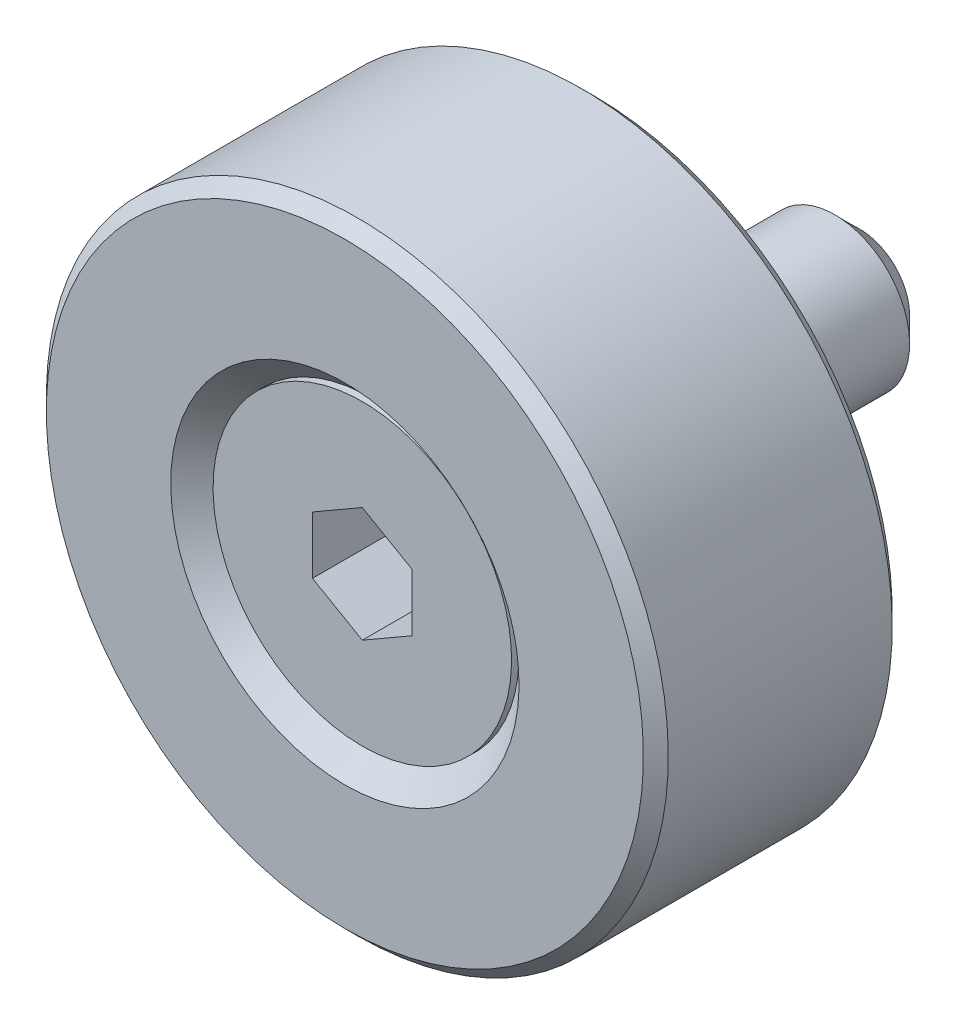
ISO-10303-21;
HEADER;
FILE_DESCRIPTION(('STEP AP214'),'2;1');
FILE_NAME('part.step','',(''),(''),'','','');
FILE_SCHEMA(('AUTOMOTIVE_DESIGN { 1 0 10303 214 1 1 1 1 }'));
ENDSEC;
DATA;
#1=APPLICATION_CONTEXT('core data for automotive mechanical design processes');
#2=APPLICATION_PROTOCOL_DEFINITION('international standard','automotive_design',2000,#1);
#3=PRODUCT_CONTEXT('',#1,'mechanical');
#4=PRODUCT('Part','Part','',(#3));
#5=PRODUCT_RELATED_PRODUCT_CATEGORY('part','',(#4));
#6=PRODUCT_DEFINITION_FORMATION('','',#4);
#7=PRODUCT_DEFINITION_CONTEXT('part definition',#1,'design');
#8=PRODUCT_DEFINITION('design','',#6,#7);
#9=PRODUCT_DEFINITION_SHAPE('','',#8);
#10=(LENGTH_UNIT() NAMED_UNIT(*) SI_UNIT(.MILLI.,.METRE.));
#11=(NAMED_UNIT(*) PLANE_ANGLE_UNIT() SI_UNIT($,.RADIAN.));
#12=(NAMED_UNIT(*) SI_UNIT($,.STERADIAN.) SOLID_ANGLE_UNIT());
#13=UNCERTAINTY_MEASURE_WITH_UNIT(LENGTH_MEASURE(1.E-05),#10,'distance_accuracy_value','');
#14=(GEOMETRIC_REPRESENTATION_CONTEXT(3) GLOBAL_UNCERTAINTY_ASSIGNED_CONTEXT((#13)) GLOBAL_UNIT_ASSIGNED_CONTEXT((#10,
#11,#12)) REPRESENTATION_CONTEXT('',''));
#15=CARTESIAN_POINT('',(0.,0.,0.));
#16=DIRECTION('',(0.,0.,1.));
#17=DIRECTION('',(1.,0.,0.));
#18=AXIS2_PLACEMENT_3D('',#15,#16,#17);
#19=CARTESIAN_POINT('',(0.,2.,-10.7));
#20=DIRECTION('',(0.,0.,1.));
#21=DIRECTION('',(0.,-1.,0.));
#22=AXIS2_PLACEMENT_3D('',#19,#20,#21);
#23=PLANE('',#22);
#24=CARTESIAN_POINT('',(0.,0.,-10.7));
#25=DIRECTION('',(0.,0.,1.));
#26=DIRECTION('',(0.,-1.,0.));
#27=AXIS2_PLACEMENT_3D('',#24,#25,#26);
#28=CIRCLE('',#27,2.);
#29=CARTESIAN_POINT('',(0.,-2.00000000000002,-10.7));
#30=VERTEX_POINT('',#29);
#31=EDGE_CURVE('E9',#30,#30,#28,.T.);
#32=ORIENTED_EDGE('',*,*,#31,.F.);
#33=EDGE_LOOP('',(#32));
#34=FACE_BOUND('',#33,.T.);
#35=ADVANCED_FACE('F14',(#34),#23,.F.);
#36=CARTESIAN_POINT('',(0.,0.,-10.7));
#37=DIRECTION('',(0.,0.,1.));
#38=DIRECTION('',(0.,-1.,0.));
#39=AXIS2_PLACEMENT_3D('',#36,#37,#38);
#40=CONICAL_SURFACE('',#39,2.,0.785398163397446);
#41=CARTESIAN_POINT('',(0.,0.,-9.7));
#42=DIRECTION('',(0.,0.,1.));
#43=DIRECTION('',(0.,-1.,0.));
#44=AXIS2_PLACEMENT_3D('',#41,#42,#43);
#45=CIRCLE('',#44,3.);
#46=CARTESIAN_POINT('',(0.,-3.00000000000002,-9.7));
#47=VERTEX_POINT('',#46);
#48=EDGE_CURVE('E21',#47,#47,#45,.T.);
#49=ORIENTED_EDGE('',*,*,#48,.F.);
#50=EDGE_LOOP('',(#49));
#51=FACE_BOUND('',#50,.T.);
#52=ORIENTED_EDGE('',*,*,#31,.T.);
#53=EDGE_LOOP('',(#52));
#54=FACE_BOUND('',#53,.T.);
#55=ADVANCED_FACE('F154',(#51,#54),#40,.T.);
#56=CARTESIAN_POINT('',(0.,0.,15.));
#57=DIRECTION('',(0.,0.,1.));
#58=DIRECTION('',(0.,-1.,0.));
#59=AXIS2_PLACEMENT_3D('',#56,#57,#58);
#60=CYLINDRICAL_SURFACE('',#59,3.);
#61=CARTESIAN_POINT('',(0.,0.,6.));
#62=DIRECTION('',(0.,0.,1.));
#63=DIRECTION('',(0.,-1.,0.));
#64=AXIS2_PLACEMENT_3D('',#61,#62,#63);
#65=CIRCLE('',#64,3.);
#66=CARTESIAN_POINT('',(0.,-2.99999999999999,6.00000000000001));
#67=VERTEX_POINT('',#66);
#68=EDGE_CURVE('E147',#67,#67,#65,.T.);
#69=ORIENTED_EDGE('',*,*,#68,.F.);
#70=EDGE_LOOP('',(#69));
#71=FACE_BOUND('',#70,.T.);
#72=ORIENTED_EDGE('',*,*,#48,.T.);
#73=EDGE_LOOP('',(#72));
#74=FACE_BOUND('',#73,.T.);
#75=ADVANCED_FACE('F152',(#71,#74),#60,.T.);
#76=CARTESIAN_POINT('',(0.,0.,6.));
#77=DIRECTION('',(0.,0.,1.));
#78=DIRECTION('',(0.,-1.,0.));
#79=AXIS2_PLACEMENT_3D('',#76,#77,#78);
#80=CONICAL_SURFACE('',#79,3.,0.785398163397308);
#81=CARTESIAN_POINT('',(0.,0.,6.19977548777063));
#82=DIRECTION('',(0.,0.,1.));
#83=DIRECTION('',(0.,-1.,0.));
#84=AXIS2_PLACEMENT_3D('',#81,#82,#83);
#85=CIRCLE('',#84,3.19977548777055);
#86=CARTESIAN_POINT('',(0.,-3.19977548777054,6.19977548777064));
#87=VERTEX_POINT('',#86);
#88=EDGE_CURVE('E144',#87,#87,#85,.T.);
#89=ORIENTED_EDGE('',*,*,#88,.F.);
#90=EDGE_LOOP('',(#89));
#91=FACE_BOUND('',#90,.T.);
#92=ORIENTED_EDGE('',*,*,#68,.T.);
#93=EDGE_LOOP('',(#92));
#94=FACE_BOUND('',#93,.T.);
#95=ADVANCED_FACE('F177',(#91,#94),#80,.T.);
#96=CARTESIAN_POINT('',(0.,0.,15.));
#97=DIRECTION('',(0.,0.,1.));
#98=DIRECTION('',(0.,-1.,0.));
#99=AXIS2_PLACEMENT_3D('',#96,#97,#98);
#100=CYLINDRICAL_SURFACE('',#99,3.19977548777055);
#101=CARTESIAN_POINT('',(0.,0.,0.));
#102=DIRECTION('',(0.,0.,1.));
#103=DIRECTION('',(0.,-1.,0.));
#104=AXIS2_PLACEMENT_3D('',#101,#102,#103);
#105=CIRCLE('',#104,3.19977548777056);
#106=CARTESIAN_POINT('',(0.,-3.19977548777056,0.));
#107=VERTEX_POINT('',#106);
#108=EDGE_CURVE('E141',#107,#107,#105,.T.);
#109=ORIENTED_EDGE('',*,*,#108,.F.);
#110=EDGE_LOOP('',(#109));
#111=FACE_BOUND('',#110,.T.);
#112=ORIENTED_EDGE('',*,*,#88,.T.);
#113=EDGE_LOOP('',(#112));
#114=FACE_BOUND('',#113,.T.);
#115=ADVANCED_FACE('F186',(#111,#114),#100,.F.);
#116=CARTESIAN_POINT('',(0.,3.19977548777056,0.));
#117=DIRECTION('',(0.,0.,1.));
#118=DIRECTION('',(0.,-1.,0.));
#119=AXIS2_PLACEMENT_3D('',#116,#117,#118);
#120=PLANE('',#119);
#121=CARTESIAN_POINT('',(0.,0.,0.));
#122=DIRECTION('',(0.,0.,1.));
#123=DIRECTION('',(0.,-1.,0.));
#124=AXIS2_PLACEMENT_3D('',#121,#122,#123);
#125=CIRCLE('',#124,12.);
#126=CARTESIAN_POINT('',(0.,-12.,0.));
#127=VERTEX_POINT('',#126);
#128=EDGE_CURVE('E138',#127,#127,#125,.T.);
#129=ORIENTED_EDGE('',*,*,#128,.F.);
#130=EDGE_LOOP('',(#129));
#131=FACE_BOUND('',#130,.T.);
#132=ORIENTED_EDGE('',*,*,#108,.T.);
#133=EDGE_LOOP('',(#132));
#134=FACE_BOUND('',#133,.T.);
#135=ADVANCED_FACE('F195',(#131,#134),#120,.F.);
#136=CARTESIAN_POINT('',(0.,0.,0.));
#137=DIRECTION('',(0.,0.,1.));
#138=DIRECTION('',(0.,-1.,0.));
#139=AXIS2_PLACEMENT_3D('',#136,#137,#138);
#140=CONICAL_SURFACE('',#139,12.,0.785398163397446);
#141=CARTESIAN_POINT('',(0.,0.,0.500000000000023));
#142=DIRECTION('',(0.,0.,1.));
#143=DIRECTION('',(0.,-1.,0.));
#144=AXIS2_PLACEMENT_3D('',#141,#142,#143);
#145=CIRCLE('',#144,12.5);
#146=CARTESIAN_POINT('',(0.,-12.5,0.500000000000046));
#147=VERTEX_POINT('',#146);
#148=EDGE_CURVE('E135',#147,#147,#145,.T.);
#149=ORIENTED_EDGE('',*,*,#148,.F.);
#150=EDGE_LOOP('',(#149));
#151=FACE_BOUND('',#150,.T.);
#152=ORIENTED_EDGE('',*,*,#128,.T.);
#153=EDGE_LOOP('',(#152));
#154=FACE_BOUND('',#153,.T.);
#155=ADVANCED_FACE('F204',(#151,#154),#140,.T.);
#156=CARTESIAN_POINT('',(0.,0.,15.));
#157=DIRECTION('',(0.,0.,1.));
#158=DIRECTION('',(0.,-1.,0.));
#159=AXIS2_PLACEMENT_3D('',#156,#157,#158);
#160=CYLINDRICAL_SURFACE('',#159,12.5);
#161=CARTESIAN_POINT('',(0.,0.,9.5));
#162=DIRECTION('',(0.,0.,1.));
#163=DIRECTION('',(0.,-1.,0.));
#164=AXIS2_PLACEMENT_3D('',#161,#162,#163);
#165=CIRCLE('',#164,12.5);
#166=CARTESIAN_POINT('',(0.,-12.5,9.50000000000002));
#167=VERTEX_POINT('',#166);
#168=EDGE_CURVE('E132',#167,#167,#165,.T.);
#169=ORIENTED_EDGE('',*,*,#168,.F.);
#170=EDGE_LOOP('',(#169));
#171=FACE_BOUND('',#170,.T.);
#172=ORIENTED_EDGE('',*,*,#148,.T.);
#173=EDGE_LOOP('',(#172));
#174=FACE_BOUND('',#173,.T.);
#175=ADVANCED_FACE('F213',(#171,#174),#160,.T.);
#176=CARTESIAN_POINT('',(0.,0.,9.5));
#177=DIRECTION('',(0.,0.,-1.));
#178=DIRECTION('',(0.,1.,0.));
#179=AXIS2_PLACEMENT_3D('',#176,#177,#178);
#180=CONICAL_SURFACE('',#179,12.5,0.785398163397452);
#181=CARTESIAN_POINT('',(0.,0.,10.));
#182=DIRECTION('',(0.,0.,1.));
#183=DIRECTION('',(0.,-1.,0.));
#184=AXIS2_PLACEMENT_3D('',#181,#182,#183);
#185=CIRCLE('',#184,12.);
#186=CARTESIAN_POINT('',(0.,-12.,10.));
#187=VERTEX_POINT('',#186);
#188=EDGE_CURVE('E129',#187,#187,#185,.T.);
#189=ORIENTED_EDGE('',*,*,#188,.F.);
#190=EDGE_LOOP('',(#189));
#191=FACE_BOUND('',#190,.T.);
#192=ORIENTED_EDGE('',*,*,#168,.T.);
#193=EDGE_LOOP('',(#192));
#194=FACE_BOUND('',#193,.T.);
#195=ADVANCED_FACE('F222',(#191,#194),#180,.T.);
#196=CARTESIAN_POINT('',(0.,12.,10.));
#197=DIRECTION('',(0.,0.,-1.));
#198=DIRECTION('',(0.,1.,0.));
#199=AXIS2_PLACEMENT_3D('',#196,#197,#198);
#200=PLANE('',#199);
#201=CARTESIAN_POINT('',(0.,0.,10.));
#202=DIRECTION('',(0.,0.,1.));
#203=DIRECTION('',(0.,-1.,0.));
#204=AXIS2_PLACEMENT_3D('',#201,#202,#203);
#205=CIRCLE('',#204,7.);
#206=CARTESIAN_POINT('',(0.,-6.99999999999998,10.));
#207=VERTEX_POINT('',#206);
#208=EDGE_CURVE('E126',#207,#207,#205,.T.);
#209=ORIENTED_EDGE('',*,*,#208,.F.);
#210=EDGE_LOOP('',(#209));
#211=FACE_BOUND('',#210,.T.);
#212=ORIENTED_EDGE('',*,*,#188,.T.);
#213=EDGE_LOOP('',(#212));
#214=FACE_BOUND('',#213,.T.);
#215=ADVANCED_FACE('F231',(#211,#214),#200,.F.);
#216=CARTESIAN_POINT('',(0.,0.,10.));
#217=DIRECTION('',(0.,0.,1.));
#218=DIRECTION('',(0.,-1.,0.));
#219=AXIS2_PLACEMENT_3D('',#216,#217,#218);
#220=CONICAL_SURFACE('',#219,7.,0.785398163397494);
#221=CARTESIAN_POINT('',(0.,0.,9.));
#222=DIRECTION('',(0.,0.,1.));
#223=DIRECTION('',(0.,-1.,0.));
#224=AXIS2_PLACEMENT_3D('',#221,#222,#223);
#225=CIRCLE('',#224,6.);
#226=CARTESIAN_POINT('',(0.,-5.99999999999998,9.00000000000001));
#227=VERTEX_POINT('',#226);
#228=EDGE_CURVE('E123',#227,#227,#225,.T.);
#229=ORIENTED_EDGE('',*,*,#228,.F.);
#230=EDGE_LOOP('',(#229));
#231=FACE_BOUND('',#230,.T.);
#232=ORIENTED_EDGE('',*,*,#208,.T.);
#233=EDGE_LOOP('',(#232));
#234=FACE_BOUND('',#233,.T.);
#235=ADVANCED_FACE('F240',(#231,#234),#220,.F.);
#236=CARTESIAN_POINT('',(0.,0.,15.));
#237=DIRECTION('',(0.,0.,1.));
#238=DIRECTION('',(0.,-1.,0.));
#239=AXIS2_PLACEMENT_3D('',#236,#237,#238);
#240=CYLINDRICAL_SURFACE('',#239,6.);
#241=CARTESIAN_POINT('',(0.,0.,9.3));
#242=DIRECTION('',(0.,0.,1.));
#243=DIRECTION('',(0.,-1.,0.));
#244=AXIS2_PLACEMENT_3D('',#241,#242,#243);
#245=CIRCLE('',#244,6.);
#246=CARTESIAN_POINT('',(0.,-5.99999999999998,9.30000000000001));
#247=VERTEX_POINT('',#246);
#248=EDGE_CURVE('E115',#247,#247,#245,.T.);
#249=ORIENTED_EDGE('',*,*,#248,.F.);
#250=EDGE_LOOP('',(#249));
#251=FACE_BOUND('',#250,.T.);
#252=ORIENTED_EDGE('',*,*,#228,.T.);
#253=EDGE_LOOP('',(#252));
#254=FACE_BOUND('',#253,.T.);
#255=ADVANCED_FACE('F249',(#251,#254),#240,.T.);
#256=CARTESIAN_POINT('',(0.,0.,9.3));
#257=DIRECTION('',(0.,0.,-1.));
#258=DIRECTION('',(0.,1.,0.));
#259=AXIS2_PLACEMENT_3D('',#256,#257,#258);
#260=PLANE('',#259);
#261=DIRECTION('',(-0.866025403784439,-0.5,0.));
#262=VECTOR('',#261,1.);
#263=CARTESIAN_POINT('',(0.,2.30940107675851,9.3));
#264=LINE('',#263,#262);
#265=CARTESIAN_POINT('',(0.,2.30940107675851,9.3));
#266=VERTEX_POINT('',#265);
#267=CARTESIAN_POINT('',(-2.,1.15470053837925,9.3));
#268=VERTEX_POINT('',#267);
#269=EDGE_CURVE('E102',#266,#268,#264,.T.);
#270=ORIENTED_EDGE('',*,*,#269,.F.);
#271=DIRECTION('',(-0.866025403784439,0.5,0.));
#272=VECTOR('',#271,1.);
#273=CARTESIAN_POINT('',(2.,1.15470053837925,9.3));
#274=LINE('',#273,#272);
#275=CARTESIAN_POINT('',(2.,1.15470053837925,9.3));
#276=VERTEX_POINT('',#275);
#277=EDGE_CURVE('E28',#276,#266,#274,.T.);
#278=ORIENTED_EDGE('',*,*,#277,.F.);
#279=DIRECTION('',(0.,1.,0.));
#280=VECTOR('',#279,1.);
#281=CARTESIAN_POINT('',(2.,-1.15470053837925,9.3));
#282=LINE('',#281,#280);
#283=CARTESIAN_POINT('',(2.,-1.15470053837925,9.3));
#284=VERTEX_POINT('',#283);
#285=EDGE_CURVE('E111',#284,#276,#282,.T.);
#286=ORIENTED_EDGE('',*,*,#285,.F.);
#287=DIRECTION('',(0.866025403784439,0.5,0.));
#288=VECTOR('',#287,1.);
#289=CARTESIAN_POINT('',(0.,-2.30940107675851,9.3));
#290=LINE('',#289,#288);
#291=CARTESIAN_POINT('',(0.,-2.30940107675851,9.3));
#292=VERTEX_POINT('',#291);
#293=EDGE_CURVE('E109',#292,#284,#290,.T.);
#294=ORIENTED_EDGE('',*,*,#293,.F.);
#295=DIRECTION('',(0.866025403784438,-0.5,0.));
#296=VECTOR('',#295,1.);
#297=CARTESIAN_POINT('',(-2.,-1.15470053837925,9.3));
#298=LINE('',#297,#296);
#299=CARTESIAN_POINT('',(-2.,-1.15470053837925,9.3));
#300=VERTEX_POINT('',#299);
#301=EDGE_CURVE('E76',#300,#292,#298,.T.);
#302=ORIENTED_EDGE('',*,*,#301,.F.);
#303=DIRECTION('',(0.,-1.,0.));
#304=VECTOR('',#303,1.);
#305=CARTESIAN_POINT('',(-2.,1.15470053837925,9.3));
#306=LINE('',#305,#304);
#307=EDGE_CURVE('E105',#268,#300,#306,.T.);
#308=ORIENTED_EDGE('',*,*,#307,.F.);
#309=EDGE_LOOP('',(#270,#278,#286,#294,#302,#308));
#310=FACE_BOUND('',#309,.T.);
#311=ORIENTED_EDGE('',*,*,#248,.T.);
#312=EDGE_LOOP('',(#311));
#313=FACE_BOUND('',#312,.T.);
#314=ADVANCED_FACE('F258',(#310,#313),#260,.F.);
#315=CARTESIAN_POINT('',(2.,1.15470053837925,6.3));
#316=DIRECTION('',(0.5,0.866025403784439,0.));
#317=DIRECTION('',(-0.866025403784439,0.5,0.));
#318=AXIS2_PLACEMENT_3D('',#315,#316,#317);
#319=PLANE('',#318);
#320=ORIENTED_EDGE('',*,*,#277,.T.);
#321=DIRECTION('',(0.,0.,1.));
#322=VECTOR('',#321,1.);
#323=CARTESIAN_POINT('',(0.,2.30940107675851,6.3));
#324=LINE('',#323,#322);
#325=CARTESIAN_POINT('',(0.,2.30940107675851,6.3));
#326=VERTEX_POINT('',#325);
#327=EDGE_CURVE('E58',#326,#266,#324,.T.);
#328=ORIENTED_EDGE('',*,*,#327,.F.);
#329=DIRECTION('',(-0.866025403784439,0.5,0.));
#330=VECTOR('',#329,1.);
#331=CARTESIAN_POINT('',(2.,1.15470053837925,6.3));
#332=LINE('',#331,#330);
#333=CARTESIAN_POINT('',(2.,1.15470053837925,6.3));
#334=VERTEX_POINT('',#333);
#335=EDGE_CURVE('E113',#334,#326,#332,.T.);
#336=ORIENTED_EDGE('',*,*,#335,.F.);
#337=DIRECTION('',(0.,0.,1.));
#338=VECTOR('',#337,1.);
#339=CARTESIAN_POINT('',(2.,1.15470053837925,6.3));
#340=LINE('',#339,#338);
#341=EDGE_CURVE('E36',#334,#276,#340,.T.);
#342=ORIENTED_EDGE('',*,*,#341,.T.);
#343=EDGE_LOOP('',(#320,#328,#336,#342));
#344=FACE_BOUND('',#343,.T.);
#345=ADVANCED_FACE('F267',(#344),#319,.F.);
#346=CARTESIAN_POINT('',(2.,-1.15470053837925,6.3));
#347=DIRECTION('',(1.,0.,0.));
#348=DIRECTION('',(0.,1.,0.));
#349=AXIS2_PLACEMENT_3D('',#346,#347,#348);
#350=PLANE('',#349);
#351=ORIENTED_EDGE('',*,*,#285,.T.);
#352=ORIENTED_EDGE('',*,*,#341,.F.);
#353=DIRECTION('',(0.,1.,0.));
#354=VECTOR('',#353,1.);
#355=CARTESIAN_POINT('',(2.,-1.15470053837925,6.3));
#356=LINE('',#355,#354);
#357=CARTESIAN_POINT('',(2.,-1.15470053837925,6.3));
#358=VERTEX_POINT('',#357);
#359=EDGE_CURVE('E88',#358,#334,#356,.T.);
#360=ORIENTED_EDGE('',*,*,#359,.F.);
#361=DIRECTION('',(0.,0.,1.));
#362=VECTOR('',#361,1.);
#363=CARTESIAN_POINT('',(2.,-1.15470053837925,6.3));
#364=LINE('',#363,#362);
#365=EDGE_CURVE('E80',#358,#284,#364,.T.);
#366=ORIENTED_EDGE('',*,*,#365,.T.);
#367=EDGE_LOOP('',(#351,#352,#360,#366));
#368=FACE_BOUND('',#367,.T.);
#369=ADVANCED_FACE('F276',(#368),#350,.F.);
#370=CARTESIAN_POINT('',(0.,-2.30940107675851,6.3));
#371=DIRECTION('',(0.5,-0.866025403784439,0.));
#372=DIRECTION('',(0.866025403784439,0.5,0.));
#373=AXIS2_PLACEMENT_3D('',#370,#371,#372);
#374=PLANE('',#373);
#375=ORIENTED_EDGE('',*,*,#293,.T.);
#376=ORIENTED_EDGE('',*,*,#365,.F.);
#377=DIRECTION('',(0.866025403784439,0.5,0.));
#378=VECTOR('',#377,1.);
#379=CARTESIAN_POINT('',(0.,-2.30940107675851,6.3));
#380=LINE('',#379,#378);
#381=CARTESIAN_POINT('',(0.,-2.30940107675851,6.3));
#382=VERTEX_POINT('',#381);
#383=EDGE_CURVE('E84',#382,#358,#380,.T.);
#384=ORIENTED_EDGE('',*,*,#383,.F.);
#385=DIRECTION('',(0.,0.,1.));
#386=VECTOR('',#385,1.);
#387=CARTESIAN_POINT('',(0.,-2.30940107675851,6.3));
#388=LINE('',#387,#386);
#389=EDGE_CURVE('E69',#382,#292,#388,.T.);
#390=ORIENTED_EDGE('',*,*,#389,.T.);
#391=EDGE_LOOP('',(#375,#376,#384,#390));
#392=FACE_BOUND('',#391,.T.);
#393=ADVANCED_FACE('F85',(#392),#374,.F.);
#394=CARTESIAN_POINT('',(-2.,-1.15470053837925,6.3));
#395=DIRECTION('',(-0.5,-0.866025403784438,0.));
#396=DIRECTION('',(0.866025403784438,-0.5,0.));
#397=AXIS2_PLACEMENT_3D('',#394,#395,#396);
#398=PLANE('',#397);
#399=ORIENTED_EDGE('',*,*,#301,.T.);
#400=ORIENTED_EDGE('',*,*,#389,.F.);
#401=DIRECTION('',(0.866025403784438,-0.5,0.));
#402=VECTOR('',#401,1.);
#403=CARTESIAN_POINT('',(-2.,-1.15470053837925,6.3));
#404=LINE('',#403,#402);
#405=CARTESIAN_POINT('',(-2.,-1.15470053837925,6.3));
#406=VERTEX_POINT('',#405);
#407=EDGE_CURVE('E73',#406,#382,#404,.T.);
#408=ORIENTED_EDGE('',*,*,#407,.F.);
#409=DIRECTION('',(0.,0.,1.));
#410=VECTOR('',#409,1.);
#411=CARTESIAN_POINT('',(-2.,-1.15470053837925,6.3));
#412=LINE('',#411,#410);
#413=EDGE_CURVE('E81',#406,#300,#412,.T.);
#414=ORIENTED_EDGE('',*,*,#413,.T.);
#415=EDGE_LOOP('',(#399,#400,#408,#414));
#416=FACE_BOUND('',#415,.T.);
#417=ADVANCED_FACE('F71',(#416),#398,.F.);
#418=CARTESIAN_POINT('',(-2.,1.15470053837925,6.3));
#419=DIRECTION('',(-1.,0.,0.));
#420=DIRECTION('',(0.,-1.,0.));
#421=AXIS2_PLACEMENT_3D('',#418,#419,#420);
#422=PLANE('',#421);
#423=ORIENTED_EDGE('',*,*,#307,.T.);
#424=ORIENTED_EDGE('',*,*,#413,.F.);
#425=DIRECTION('',(0.,-1.,0.));
#426=VECTOR('',#425,1.);
#427=CARTESIAN_POINT('',(-2.,1.15470053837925,6.3));
#428=LINE('',#427,#426);
#429=CARTESIAN_POINT('',(-2.,1.15470053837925,6.3));
#430=VERTEX_POINT('',#429);
#431=EDGE_CURVE('E94',#430,#406,#428,.T.);
#432=ORIENTED_EDGE('',*,*,#431,.F.);
#433=DIRECTION('',(0.,0.,1.));
#434=VECTOR('',#433,1.);
#435=CARTESIAN_POINT('',(-2.,1.15470053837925,6.3));
#436=LINE('',#435,#434);
#437=EDGE_CURVE('E118',#430,#268,#436,.T.);
#438=ORIENTED_EDGE('',*,*,#437,.T.);
#439=EDGE_LOOP('',(#423,#424,#432,#438));
#440=FACE_BOUND('',#439,.T.);
#441=ADVANCED_FACE('F298',(#440),#422,.F.);
#442=CARTESIAN_POINT('',(0.,2.30940107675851,6.3));
#443=DIRECTION('',(-0.5,0.866025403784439,0.));
#444=DIRECTION('',(-0.866025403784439,-0.5,0.));
#445=AXIS2_PLACEMENT_3D('',#442,#443,#444);
#446=PLANE('',#445);
#447=ORIENTED_EDGE('',*,*,#269,.T.);
#448=ORIENTED_EDGE('',*,*,#437,.F.);
#449=DIRECTION('',(-0.866025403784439,-0.5,0.));
#450=VECTOR('',#449,1.);
#451=CARTESIAN_POINT('',(0.,2.30940107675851,6.3));
#452=LINE('',#451,#450);
#453=EDGE_CURVE('E96',#326,#430,#452,.T.);
#454=ORIENTED_EDGE('',*,*,#453,.F.);
#455=ORIENTED_EDGE('',*,*,#327,.T.);
#456=EDGE_LOOP('',(#447,#448,#454,#455));
#457=FACE_BOUND('',#456,.T.);
#458=ADVANCED_FACE('F306',(#457),#446,.F.);
#459=CARTESIAN_POINT('',(0.,2.30940107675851,6.3));
#460=DIRECTION('',(0.,0.,1.));
#461=DIRECTION('',(1.,0.,0.));
#462=AXIS2_PLACEMENT_3D('',#459,#460,#461);
#463=PLANE('',#462);
#464=ORIENTED_EDGE('',*,*,#335,.T.);
#465=ORIENTED_EDGE('',*,*,#453,.T.);
#466=ORIENTED_EDGE('',*,*,#431,.T.);
#467=ORIENTED_EDGE('',*,*,#407,.T.);
#468=ORIENTED_EDGE('',*,*,#383,.T.);
#469=ORIENTED_EDGE('',*,*,#359,.T.);
#470=EDGE_LOOP('',(#464,#465,#466,#467,#468,#469));
#471=FACE_BOUND('',#470,.T.);
#472=ADVANCED_FACE('F91',(#471),#463,.T.);
#473=CLOSED_SHELL('',(#35,#55,#75,#95,#115,#135,#155,#175,#195,#215,#235,#255,#314,#345,#369,
#393,#417,#441,#458,#472));
#474=MANIFOLD_SOLID_BREP('B1',#473);
#475=ADVANCED_BREP_SHAPE_REPRESENTATION('',(#18,#474),#14);
#476=SHAPE_DEFINITION_REPRESENTATION(#9,#475);
ENDSEC;
END-ISO-10303-21;
